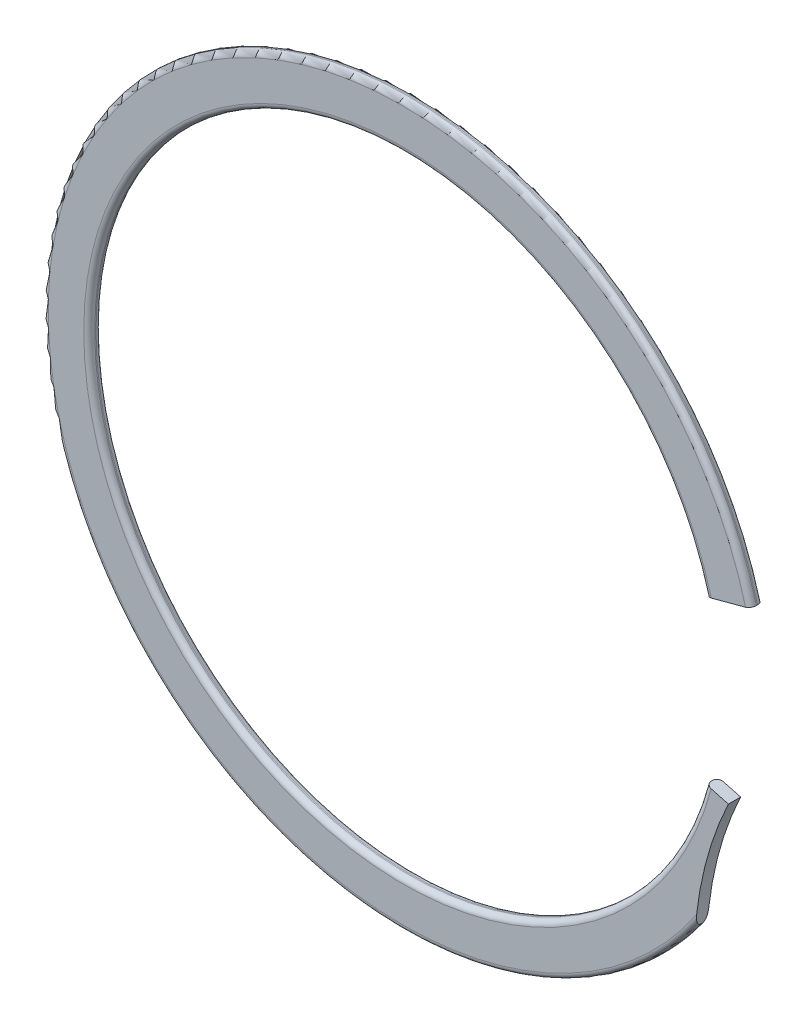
ISO-10303-21;
HEADER;
FILE_DESCRIPTION(('STEP AP214'),'2;1');
FILE_NAME('part.step','',(''),(''),'','','');
FILE_SCHEMA(('AUTOMOTIVE_DESIGN { 1 0 10303 214 1 1 1 1 }'));
ENDSEC;
DATA;
#1=APPLICATION_CONTEXT('core data for automotive mechanical design processes');
#2=APPLICATION_PROTOCOL_DEFINITION('international standard','automotive_design',2000,#1);
#3=PRODUCT_CONTEXT('',#1,'mechanical');
#4=PRODUCT('Part','Part','',(#3));
#5=PRODUCT_RELATED_PRODUCT_CATEGORY('part','',(#4));
#6=PRODUCT_DEFINITION_FORMATION('','',#4);
#7=PRODUCT_DEFINITION_CONTEXT('part definition',#1,'design');
#8=PRODUCT_DEFINITION('design','',#6,#7);
#9=PRODUCT_DEFINITION_SHAPE('','',#8);
#10=(LENGTH_UNIT() NAMED_UNIT(*) SI_UNIT(.MILLI.,.METRE.));
#11=(NAMED_UNIT(*) PLANE_ANGLE_UNIT() SI_UNIT($,.RADIAN.));
#12=(NAMED_UNIT(*) SI_UNIT($,.STERADIAN.) SOLID_ANGLE_UNIT());
#13=UNCERTAINTY_MEASURE_WITH_UNIT(LENGTH_MEASURE(1.E-05),#10,'distance_accuracy_value','');
#14=(GEOMETRIC_REPRESENTATION_CONTEXT(3) GLOBAL_UNCERTAINTY_ASSIGNED_CONTEXT((#13)) GLOBAL_UNIT_ASSIGNED_CONTEXT((#10,
#11,#12)) REPRESENTATION_CONTEXT('',''));
#15=CARTESIAN_POINT('',(0.,0.,0.));
#16=DIRECTION('',(0.,0.,1.));
#17=DIRECTION('',(1.,0.,0.));
#18=AXIS2_PLACEMENT_3D('',#15,#16,#17);
#19=CARTESIAN_POINT('',(0.,0.,0.3937));
#20=DIRECTION('',(0.,0.,-1.));
#21=DIRECTION('',(-1.,0.,0.));
#22=AXIS2_PLACEMENT_3D('',#19,#20,#21);
#23=CYLINDRICAL_SURFACE('',#22,20.2057);
#24=DIRECTION('',(0.,0.,-1.));
#25=VECTOR('',#24,1.);
#26=CARTESIAN_POINT('',(19.517207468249,-5.22961997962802,0.3937));
#27=LINE('',#26,#25);
#28=CARTESIAN_POINT('',(19.517207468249,-5.22961997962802,0.0393699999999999));
#29=VERTEX_POINT('',#28);
#30=CARTESIAN_POINT('',(19.517207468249,-5.22961997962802,-0.0393699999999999));
#31=VERTEX_POINT('',#30);
#32=EDGE_CURVE('E161',#29,#31,#27,.T.);
#33=ORIENTED_EDGE('',*,*,#32,.T.);
#34=CARTESIAN_POINT('',(0.,0.,-0.0393699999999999));
#35=DIRECTION('',(0.,0.,1.));
#36=DIRECTION('',(1.,0.,0.));
#37=AXIS2_PLACEMENT_3D('',#34,#35,#36);
#38=CIRCLE('',#37,20.2057);
#39=CARTESIAN_POINT('',(19.517207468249,5.22961997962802,-0.0393699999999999));
#40=VERTEX_POINT('',#39);
#41=EDGE_CURVE('E197',#31,#40,#38,.F.);
#42=ORIENTED_EDGE('',*,*,#41,.T.);
#43=DIRECTION('',(0.,0.,-1.));
#44=VECTOR('',#43,1.);
#45=CARTESIAN_POINT('',(19.517207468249,5.22961997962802,0.3937));
#46=LINE('',#45,#44);
#47=CARTESIAN_POINT('',(19.517207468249,5.22961997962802,0.0393699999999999));
#48=VERTEX_POINT('',#47);
#49=EDGE_CURVE('E190',#48,#40,#46,.T.);
#50=ORIENTED_EDGE('',*,*,#49,.F.);
#51=CARTESIAN_POINT('',(0.,0.,0.0393699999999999));
#52=DIRECTION('',(0.,0.,1.));
#53=DIRECTION('',(1.,0.,0.));
#54=AXIS2_PLACEMENT_3D('',#51,#52,#53);
#55=CIRCLE('',#54,20.2057);
#56=EDGE_CURVE('E194',#48,#29,#55,.T.);
#57=ORIENTED_EDGE('',*,*,#56,.T.);
#58=EDGE_LOOP('',(#33,#42,#50,#57));
#59=FACE_BOUND('',#58,.T.);
#60=ADVANCED_FACE('F44',(#59),#23,.F.);
#61=CARTESIAN_POINT('',(19.517207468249,5.22961997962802,0.3937));
#62=DIRECTION('',(-0.258819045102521,0.965925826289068,0.));
#63=DIRECTION('',(-0.965925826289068,-0.258819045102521,0.));
#64=AXIS2_PLACEMENT_3D('',#61,#62,#63);
#65=PLANE('',#64);
#66=ORIENTED_EDGE('',*,*,#49,.T.);
#67=CARTESIAN_POINT('',(19.859463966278,5.32132733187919,-0.0393699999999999));
#68=DIRECTION('',(-0.258819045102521,0.965925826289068,0.));
#69=DIRECTION('',(-0.965925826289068,-0.258819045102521,0.));
#70=AXIS2_PLACEMENT_3D('',#67,#68,#69);
#71=CIRCLE('',#70,0.35433);
#72=CARTESIAN_POINT('',(19.859463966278,5.32132733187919,-0.3937));
#73=VERTEX_POINT('',#72);
#74=EDGE_CURVE('E210',#40,#73,#71,.F.);
#75=ORIENTED_EDGE('',*,*,#74,.T.);
#76=DIRECTION('',(0.965925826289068,0.258819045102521,0.));
#77=VECTOR('',#76,1.);
#78=CARTESIAN_POINT('',(19.517207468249,5.22961997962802,-0.3937));
#79=LINE('',#78,#77);
#80=CARTESIAN_POINT('',(22.0700238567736,5.91364506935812,-0.3937));
#81=VERTEX_POINT('',#80);
#82=EDGE_CURVE('E175',#73,#81,#79,.T.);
#83=ORIENTED_EDGE('',*,*,#82,.T.);
#84=CARTESIAN_POINT('',(22.0700238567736,5.91364506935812,-0.0393699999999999));
#85=DIRECTION('',(-0.258819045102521,0.965925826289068,0.));
#86=DIRECTION('',(-0.965925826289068,-0.258819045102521,0.));
#87=AXIS2_PLACEMENT_3D('',#84,#85,#86);
#88=CIRCLE('',#87,0.35433);
#89=CARTESIAN_POINT('',(22.4122803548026,6.00535242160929,-0.0393699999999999));
#90=VERTEX_POINT('',#89);
#91=EDGE_CURVE('E204',#81,#90,#88,.F.);
#92=ORIENTED_EDGE('',*,*,#91,.T.);
#93=DIRECTION('',(0.,0.,-1.));
#94=VECTOR('',#93,1.);
#95=CARTESIAN_POINT('',(22.4122803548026,6.00535242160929,0.3937));
#96=LINE('',#95,#94);
#97=CARTESIAN_POINT('',(22.4122803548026,6.00535242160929,0.0393699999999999));
#98=VERTEX_POINT('',#97);
#99=EDGE_CURVE('E186',#98,#90,#96,.T.);
#100=ORIENTED_EDGE('',*,*,#99,.F.);
#101=CARTESIAN_POINT('',(22.0700238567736,5.91364506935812,0.0393699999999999));
#102=DIRECTION('',(-0.258819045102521,0.965925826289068,0.));
#103=DIRECTION('',(-0.965925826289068,-0.258819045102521,0.));
#104=AXIS2_PLACEMENT_3D('',#101,#102,#103);
#105=CIRCLE('',#104,0.35433);
#106=CARTESIAN_POINT('',(22.0700238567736,5.91364506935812,0.3937));
#107=VERTEX_POINT('',#106);
#108=EDGE_CURVE('E201',#98,#107,#105,.F.);
#109=ORIENTED_EDGE('',*,*,#108,.T.);
#110=DIRECTION('',(0.965925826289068,0.258819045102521,0.));
#111=VECTOR('',#110,1.);
#112=CARTESIAN_POINT('',(19.517207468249,5.22961997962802,0.3937));
#113=LINE('',#112,#111);
#114=CARTESIAN_POINT('',(19.859463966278,5.32132733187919,0.3937));
#115=VERTEX_POINT('',#114);
#116=EDGE_CURVE('E149',#115,#107,#113,.T.);
#117=ORIENTED_EDGE('',*,*,#116,.F.);
#118=CARTESIAN_POINT('',(19.859463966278,5.32132733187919,0.0393699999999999));
#119=DIRECTION('',(-0.258819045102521,0.965925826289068,0.));
#120=DIRECTION('',(-0.965925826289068,-0.258819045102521,0.));
#121=AXIS2_PLACEMENT_3D('',#118,#119,#120);
#122=CIRCLE('',#121,0.35433);
#123=EDGE_CURVE('E207',#115,#48,#122,.F.);
#124=ORIENTED_EDGE('',*,*,#123,.T.);
#125=EDGE_LOOP('',(#66,#75,#83,#92,#100,#109,#117,#124));
#126=FACE_BOUND('',#125,.T.);
#127=ADVANCED_FACE('F246',(#126),#65,.F.);
#128=CARTESIAN_POINT('',(0.,0.,0.3937));
#129=DIRECTION('',(0.,0.,-1.));
#130=DIRECTION('',(-1.,0.,0.));
#131=AXIS2_PLACEMENT_3D('',#128,#129,#130);
#132=CYLINDRICAL_SURFACE('',#131,23.2029);
#133=ORIENTED_EDGE('',*,*,#99,.T.);
#134=CARTESIAN_POINT('',(0.,0.,-0.0393699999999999));
#135=DIRECTION('',(0.,0.,1.));
#136=DIRECTION('',(1.,0.,0.));
#137=AXIS2_PLACEMENT_3D('',#134,#135,#136);
#138=CIRCLE('',#137,23.2029);
#139=CARTESIAN_POINT('',(18.8415137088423,-13.5414891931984,-0.0393699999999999));
#140=VERTEX_POINT('',#139);
#141=EDGE_CURVE('E231',#90,#140,#138,.T.);
#142=ORIENTED_EDGE('',*,*,#141,.T.);
#143=DIRECTION('',(0.,0.,-1.));
#144=VECTOR('',#143,1.);
#145=CARTESIAN_POINT('',(18.8415137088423,-13.5414891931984,0.3937));
#146=LINE('',#145,#144);
#147=CARTESIAN_POINT('',(18.8415137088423,-13.5414891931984,0.0393699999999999));
#148=VERTEX_POINT('',#147);
#149=EDGE_CURVE('E160',#148,#140,#146,.T.);
#150=ORIENTED_EDGE('',*,*,#149,.F.);
#151=CARTESIAN_POINT('',(0.,0.,0.0393699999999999));
#152=DIRECTION('',(0.,0.,1.));
#153=DIRECTION('',(1.,0.,0.));
#154=AXIS2_PLACEMENT_3D('',#151,#152,#153);
#155=CIRCLE('',#154,23.2029);
#156=EDGE_CURVE('E228',#148,#98,#155,.F.);
#157=ORIENTED_EDGE('',*,*,#156,.T.);
#158=EDGE_LOOP('',(#133,#142,#150,#157));
#159=FACE_BOUND('',#158,.T.);
#160=ADVANCED_FACE('F241',(#159),#132,.T.);
#161=CARTESIAN_POINT('',(41.5916409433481,-15.3909070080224,0.3937));
#162=DIRECTION('',(0.,0.,-1.));
#163=DIRECTION('',(-1.,0.,0.));
#164=AXIS2_PLACEMENT_3D('',#161,#162,#163);
#165=CYLINDRICAL_SURFACE('',#164,22.8251754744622);
#166=ORIENTED_EDGE('',*,*,#149,.T.);
#167=CARTESIAN_POINT('',(18.8415137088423,-13.5414891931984,-0.0393699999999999));
#168=CARTESIAN_POINT('',(18.8415118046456,-13.5415152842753,-0.0503866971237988));
#169=CARTESIAN_POINT('',(18.8415942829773,-13.5404979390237,-0.0613708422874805));
#170=CARTESIAN_POINT('',(18.8419104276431,-13.5366138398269,-0.0828961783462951));
#171=CARTESIAN_POINT('',(18.8421425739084,-13.5337656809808,-0.0934407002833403));
#172=CARTESIAN_POINT('',(18.8428069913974,-13.5256434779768,-0.116197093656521));
#173=CARTESIAN_POINT('',(18.8432720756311,-13.5199733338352,-0.128264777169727));
#174=CARTESIAN_POINT('',(18.8443634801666,-13.5067499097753,-0.15134399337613));
#175=CARTESIAN_POINT('',(18.8449904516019,-13.4991890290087,-0.162351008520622));
#176=CARTESIAN_POINT('',(18.8467206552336,-13.4784764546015,-0.188554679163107));
#177=CARTESIAN_POINT('',(18.847904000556,-13.4644361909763,-0.203037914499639));
#178=CARTESIAN_POINT('',(18.850470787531,-13.4343676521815,-0.229703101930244));
#179=CARTESIAN_POINT('',(18.851854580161,-13.4183358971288,-0.24188092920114));
#180=CARTESIAN_POINT('',(18.8559217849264,-13.3718487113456,-0.273126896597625));
#181=CARTESIAN_POINT('',(18.858769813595,-13.3399850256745,-0.290059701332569));
#182=CARTESIAN_POINT('',(18.8648065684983,-13.2741297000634,-0.319301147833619));
#183=CARTESIAN_POINT('',(18.8679972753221,-13.2401262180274,-0.331580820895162));
#184=CARTESIAN_POINT('',(18.8743387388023,-13.1741953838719,-0.35143610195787));
#185=CARTESIAN_POINT('',(18.8774664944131,-13.1423623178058,-0.359339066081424));
#186=CARTESIAN_POINT('',(18.883914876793,-13.0781475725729,-0.372529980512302));
#187=CARTESIAN_POINT('',(18.8872357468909,-13.0457652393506,-0.377814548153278));
#188=CARTESIAN_POINT('',(18.8939609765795,-12.9815556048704,-0.385975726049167));
#189=CARTESIAN_POINT('',(18.8973611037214,-12.9497349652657,-0.38890982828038));
#190=CARTESIAN_POINT('',(18.9042987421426,-12.8860783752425,-0.392762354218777));
#191=CARTESIAN_POINT('',(18.907835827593,-12.8542427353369,-0.393686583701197));
#192=CARTESIAN_POINT('',(18.9114394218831,-12.8224260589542,-0.3937));
#193=B_SPLINE_CURVE_WITH_KNOTS('',3,(#167,#168,#169,#170,#171,#172,#173,#174,#175,#176,#177,
#178,#179,#180,#181,#182,#183,#184,#185,#186,#187,#188,#189,#190,#191,#192),.UNSPECIFIED.,.F.,
.F.,(4,2,2,2,2,2,2,2,2,2,2,2,4),(0.,0.0329501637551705,0.0655708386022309,0.105375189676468,
0.145342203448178,0.205619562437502,0.266003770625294,0.373986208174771,0.482630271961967,
0.581344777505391,0.680186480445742,0.776529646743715,0.872594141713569),.UNSPECIFIED.);
#194=CARTESIAN_POINT('',(18.9114394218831,-12.8224260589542,-0.3937));
#195=VERTEX_POINT('',#194);
#196=EDGE_CURVE('E11',#140,#195,#193,.T.);
#197=ORIENTED_EDGE('',*,*,#196,.T.);
#198=CARTESIAN_POINT('',(41.5916409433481,-15.3909070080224,-0.3937));
#199=DIRECTION('',(0.,0.,-1.));
#200=DIRECTION('',(1.,0.,0.));
#201=AXIS2_PLACEMENT_3D('',#198,#199,#200);
#202=CIRCLE('',#201,22.8251754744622);
#203=CARTESIAN_POINT('',(20.9647439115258,-5.61748620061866,-0.3937));
#204=VERTEX_POINT('',#203);
#205=EDGE_CURVE('E155',#195,#204,#202,.T.);
#206=ORIENTED_EDGE('',*,*,#205,.T.);
#207=DIRECTION('',(0.,0.,-1.));
#208=VECTOR('',#207,1.);
#209=CARTESIAN_POINT('',(20.9647439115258,-5.61748620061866,0.3937));
#210=LINE('',#209,#208);
#211=CARTESIAN_POINT('',(20.9647439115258,-5.61748620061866,0.3937));
#212=VERTEX_POINT('',#211);
#213=EDGE_CURVE('E152',#212,#204,#210,.T.);
#214=ORIENTED_EDGE('',*,*,#213,.F.);
#215=CARTESIAN_POINT('',(41.5916409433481,-15.3909070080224,0.3937));
#216=DIRECTION('',(0.,0.,-1.));
#217=DIRECTION('',(1.,0.,0.));
#218=AXIS2_PLACEMENT_3D('',#215,#216,#217);
#219=CIRCLE('',#218,22.8251754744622);
#220=CARTESIAN_POINT('',(18.9114394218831,-12.8224260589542,0.3937));
#221=VERTEX_POINT('',#220);
#222=EDGE_CURVE('E138',#221,#212,#219,.T.);
#223=ORIENTED_EDGE('',*,*,#222,.F.);
#224=CARTESIAN_POINT('',(18.9114394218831,-12.8224260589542,0.3937));
#225=CARTESIAN_POINT('',(18.9071360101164,-12.8604173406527,0.393671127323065));
#226=CARTESIAN_POINT('',(18.9029266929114,-12.8984485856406,0.392361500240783));
#227=CARTESIAN_POINT('',(18.8946931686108,-12.9745749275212,0.386823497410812));
#228=CARTESIAN_POINT('',(18.890670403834,-13.0126687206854,0.382575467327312));
#229=CARTESIAN_POINT('',(18.882816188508,-13.088863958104,0.370719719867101));
#230=CARTESIAN_POINT('',(18.8789878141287,-13.1269593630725,0.363070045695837));
#231=CARTESIAN_POINT('',(18.8716257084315,-13.2020816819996,0.343776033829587));
#232=CARTESIAN_POINT('',(18.8680910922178,-13.2391115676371,0.332144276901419));
#233=CARTESIAN_POINT('',(18.8629331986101,-13.2945148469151,0.310401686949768));
#234=CARTESIAN_POINT('',(18.8611833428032,-13.3135805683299,0.30208463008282));
#235=CARTESIAN_POINT('',(18.857803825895,-13.350898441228,0.283750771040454));
#236=CARTESIAN_POINT('',(18.8561741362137,-13.3691507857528,0.273734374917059));
#237=CARTESIAN_POINT('',(18.8530499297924,-13.4045954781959,0.251601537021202));
#238=CARTESIAN_POINT('',(18.8515567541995,-13.4217768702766,0.239467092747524));
#239=CARTESIAN_POINT('',(18.8487738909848,-13.4541840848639,0.212784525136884));
#240=CARTESIAN_POINT('',(18.8474837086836,-13.4694146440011,0.198242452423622));
#241=CARTESIAN_POINT('',(18.8456535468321,-13.4912330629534,0.172825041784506));
#242=CARTESIAN_POINT('',(18.8450205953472,-13.4988325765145,0.162828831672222));
#243=CARTESIAN_POINT('',(18.8438849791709,-13.5125350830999,0.141838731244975));
#244=CARTESIAN_POINT('',(18.8433822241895,-13.5186391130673,0.130845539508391));
#245=CARTESIAN_POINT('',(18.8425915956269,-13.5282718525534,0.109394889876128));
#246=CARTESIAN_POINT('',(18.8422847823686,-13.532026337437,0.0990406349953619));
#247=CARTESIAN_POINT('',(18.8418178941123,-13.5377487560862,0.077858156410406));
#248=CARTESIAN_POINT('',(18.8416574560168,-13.53972111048,0.067031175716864));
#249=CARTESIAN_POINT('',(18.8415343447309,-13.5412354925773,0.0505524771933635));
#250=CARTESIAN_POINT('',(18.8415133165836,-13.5414944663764,0.0449606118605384));
#251=CARTESIAN_POINT('',(18.8415137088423,-13.5414891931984,0.0393700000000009));
#252=B_SPLINE_CURVE_WITH_KNOTS('',3,(#224,#225,#226,#227,#228,#229,#230,#231,#232,#233,#234,
#235,#236,#237,#238,#239,#240,#241,#242,#243,#244,#245,#246,#247,#248,#249,#250,#251),
.UNSPECIFIED.,.F.,.F.,(4,2,2,2,2,2,2,2,2,2,2,2,2,4),(0.,0.114726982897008,0.230228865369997,
0.347196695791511,0.46379834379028,0.526357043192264,0.588900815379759,0.652004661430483,
0.714952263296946,0.752570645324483,0.79016286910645,0.82308332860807,0.855921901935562,
0.87269272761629),.UNSPECIFIED.);
#253=EDGE_CURVE('E58',#221,#148,#252,.T.);
#254=ORIENTED_EDGE('',*,*,#253,.T.);
#255=EDGE_LOOP('',(#166,#197,#206,#214,#223,#254));
#256=FACE_BOUND('',#255,.T.);
#257=ADVANCED_FACE('F153',(#256),#165,.F.);
#258=CARTESIAN_POINT('',(19.517207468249,-5.22961997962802,0.3937));
#259=DIRECTION('',(-0.258819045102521,-0.965925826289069,0.));
#260=DIRECTION('',(0.965925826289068,-0.258819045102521,0.));
#261=AXIS2_PLACEMENT_3D('',#258,#259,#260);
#262=PLANE('',#261);
#263=DIRECTION('',(-0.965925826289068,0.258819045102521,0.));
#264=VECTOR('',#263,1.);
#265=CARTESIAN_POINT('',(19.517207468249,-5.22961997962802,-0.3937));
#266=LINE('',#265,#264);
#267=CARTESIAN_POINT('',(19.859463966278,-5.32132733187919,-0.3937));
#268=VERTEX_POINT('',#267);
#269=EDGE_CURVE('E181',#204,#268,#266,.T.);
#270=ORIENTED_EDGE('',*,*,#269,.T.);
#271=CARTESIAN_POINT('',(19.859463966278,-5.32132733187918,-0.0393699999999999));
#272=DIRECTION('',(-0.258819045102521,-0.965925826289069,0.));
#273=DIRECTION('',(0.965925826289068,-0.258819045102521,0.));
#274=AXIS2_PLACEMENT_3D('',#271,#272,#273);
#275=CIRCLE('',#274,0.35433);
#276=EDGE_CURVE('E220',#268,#31,#275,.F.);
#277=ORIENTED_EDGE('',*,*,#276,.T.);
#278=ORIENTED_EDGE('',*,*,#32,.F.);
#279=CARTESIAN_POINT('',(19.859463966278,-5.32132733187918,0.0393699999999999));
#280=DIRECTION('',(-0.258819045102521,-0.965925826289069,0.));
#281=DIRECTION('',(0.965925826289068,-0.258819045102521,0.));
#282=AXIS2_PLACEMENT_3D('',#279,#280,#281);
#283=CIRCLE('',#282,0.35433);
#284=CARTESIAN_POINT('',(19.859463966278,-5.32132733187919,0.3937));
#285=VERTEX_POINT('',#284);
#286=EDGE_CURVE('E166',#29,#285,#283,.F.);
#287=ORIENTED_EDGE('',*,*,#286,.T.);
#288=DIRECTION('',(-0.965925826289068,0.258819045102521,0.));
#289=VECTOR('',#288,1.);
#290=CARTESIAN_POINT('',(19.517207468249,-5.22961997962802,0.3937));
#291=LINE('',#290,#289);
#292=EDGE_CURVE('E143',#212,#285,#291,.T.);
#293=ORIENTED_EDGE('',*,*,#292,.F.);
#294=ORIENTED_EDGE('',*,*,#213,.T.);
#295=EDGE_LOOP('',(#270,#277,#278,#287,#293,#294));
#296=FACE_BOUND('',#295,.T.);
#297=ADVANCED_FACE('F163',(#296),#262,.F.);
#298=CARTESIAN_POINT('',(0.,0.,0.3937));
#299=DIRECTION('',(0.,0.,1.));
#300=DIRECTION('',(1.,0.,0.));
#301=AXIS2_PLACEMENT_3D('',#298,#299,#300);
#302=PLANE('',#301);
#303=ORIENTED_EDGE('',*,*,#292,.T.);
#304=CARTESIAN_POINT('',(0.,0.,0.3937));
#305=DIRECTION('',(0.,0.,1.));
#306=DIRECTION('',(1.,0.,0.));
#307=AXIS2_PLACEMENT_3D('',#304,#305,#306);
#308=CIRCLE('',#307,20.56003);
#309=EDGE_CURVE('E225',#285,#115,#308,.F.);
#310=ORIENTED_EDGE('',*,*,#309,.T.);
#311=ORIENTED_EDGE('',*,*,#116,.T.);
#312=CARTESIAN_POINT('',(0.,0.,0.3937));
#313=DIRECTION('',(0.,0.,1.));
#314=DIRECTION('',(1.,0.,0.));
#315=AXIS2_PLACEMENT_3D('',#312,#313,#314);
#316=CIRCLE('',#315,22.84857);
#317=EDGE_CURVE('E147',#107,#221,#316,.T.);
#318=ORIENTED_EDGE('',*,*,#317,.T.);
#319=ORIENTED_EDGE('',*,*,#222,.T.);
#320=EDGE_LOOP('',(#303,#310,#311,#318,#319));
#321=FACE_BOUND('',#320,.T.);
#322=ADVANCED_FACE('F140',(#321),#302,.T.);
#323=CARTESIAN_POINT('',(0.,0.,-0.3937));
#324=DIRECTION('',(0.,0.,1.));
#325=DIRECTION('',(1.,0.,0.));
#326=AXIS2_PLACEMENT_3D('',#323,#324,#325);
#327=PLANE('',#326);
#328=ORIENTED_EDGE('',*,*,#82,.F.);
#329=CARTESIAN_POINT('',(0.,0.,-0.3937));
#330=DIRECTION('',(0.,0.,1.));
#331=DIRECTION('',(1.,0.,0.));
#332=AXIS2_PLACEMENT_3D('',#329,#330,#331);
#333=CIRCLE('',#332,20.56003);
#334=EDGE_CURVE('E216',#73,#268,#333,.T.);
#335=ORIENTED_EDGE('',*,*,#334,.T.);
#336=ORIENTED_EDGE('',*,*,#269,.F.);
#337=ORIENTED_EDGE('',*,*,#205,.F.);
#338=CARTESIAN_POINT('',(0.,0.,-0.3937));
#339=DIRECTION('',(0.,0.,1.));
#340=DIRECTION('',(1.,0.,0.));
#341=AXIS2_PLACEMENT_3D('',#338,#339,#340);
#342=CIRCLE('',#341,22.84857);
#343=EDGE_CURVE('E213',#195,#81,#342,.F.);
#344=ORIENTED_EDGE('',*,*,#343,.T.);
#345=EDGE_LOOP('',(#328,#335,#336,#337,#344));
#346=FACE_BOUND('',#345,.T.);
#347=ADVANCED_FACE('F258',(#346),#327,.F.);
#348=CARTESIAN_POINT('',(0.,0.,-0.0393699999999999));
#349=DIRECTION('',(0.,0.,1.));
#350=DIRECTION('',(1.,0.,0.));
#351=AXIS2_PLACEMENT_3D('',#348,#349,#350);
#352=TOROIDAL_SURFACE('',#351,20.56003,0.35433);
#353=ORIENTED_EDGE('',*,*,#276,.F.);
#354=ORIENTED_EDGE('',*,*,#334,.F.);
#355=ORIENTED_EDGE('',*,*,#74,.F.);
#356=ORIENTED_EDGE('',*,*,#41,.F.);
#357=EDGE_LOOP('',(#353,#354,#355,#356));
#358=FACE_BOUND('',#357,.T.);
#359=ADVANCED_FACE('F254',(#358),#352,.T.);
#360=CARTESIAN_POINT('',(0.,0.,0.0393699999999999));
#361=DIRECTION('',(0.,0.,1.));
#362=DIRECTION('',(1.,0.,0.));
#363=AXIS2_PLACEMENT_3D('',#360,#361,#362);
#364=TOROIDAL_SURFACE('',#363,20.56003,0.35433);
#365=ORIENTED_EDGE('',*,*,#286,.F.);
#366=ORIENTED_EDGE('',*,*,#56,.F.);
#367=ORIENTED_EDGE('',*,*,#123,.F.);
#368=ORIENTED_EDGE('',*,*,#309,.F.);
#369=EDGE_LOOP('',(#365,#366,#367,#368));
#370=FACE_BOUND('',#369,.T.);
#371=ADVANCED_FACE('F257',(#370),#364,.T.);
#372=CARTESIAN_POINT('',(0.,0.,-0.0393699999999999));
#373=DIRECTION('',(0.,0.,1.));
#374=DIRECTION('',(1.,0.,0.));
#375=AXIS2_PLACEMENT_3D('',#372,#373,#374);
#376=TOROIDAL_SURFACE('',#375,22.84857,0.35433);
#377=ORIENTED_EDGE('',*,*,#91,.F.);
#378=ORIENTED_EDGE('',*,*,#343,.F.);
#379=ORIENTED_EDGE('',*,*,#196,.F.);
#380=ORIENTED_EDGE('',*,*,#141,.F.);
#381=EDGE_LOOP('',(#377,#378,#379,#380));
#382=FACE_BOUND('',#381,.T.);
#383=ADVANCED_FACE('F261',(#382),#376,.T.);
#384=CARTESIAN_POINT('',(0.,0.,0.0393699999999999));
#385=DIRECTION('',(0.,0.,1.));
#386=DIRECTION('',(1.,0.,0.));
#387=AXIS2_PLACEMENT_3D('',#384,#385,#386);
#388=TOROIDAL_SURFACE('',#387,22.84857,0.35433);
#389=ORIENTED_EDGE('',*,*,#108,.F.);
#390=ORIENTED_EDGE('',*,*,#156,.F.);
#391=ORIENTED_EDGE('',*,*,#253,.F.);
#392=ORIENTED_EDGE('',*,*,#317,.F.);
#393=EDGE_LOOP('',(#389,#390,#391,#392));
#394=FACE_BOUND('',#393,.T.);
#395=ADVANCED_FACE('F46',(#394),#388,.T.);
#396=CLOSED_SHELL('',(#60,#127,#160,#257,#297,#322,#347,#359,#371,#383,#395));
#397=MANIFOLD_SOLID_BREP('B2',#396);
#398=ADVANCED_BREP_SHAPE_REPRESENTATION('',(#18,#397),#14);
#399=SHAPE_DEFINITION_REPRESENTATION(#9,#398);
ENDSEC;
END-ISO-10303-21;
